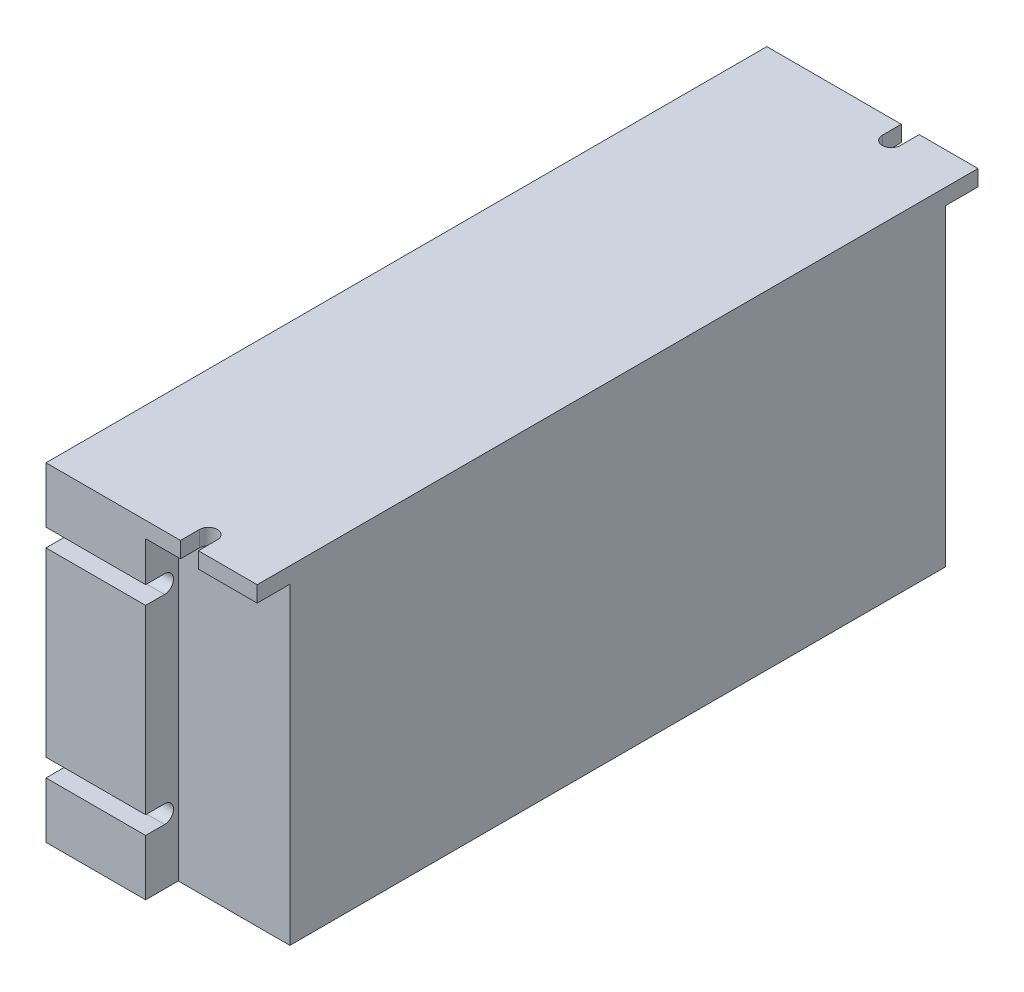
ISO-10303-21;
HEADER;
FILE_DESCRIPTION(('STEP AP214'),'2;1');
FILE_NAME('part.step','',(''),(''),'','','');
FILE_SCHEMA(('AUTOMOTIVE_DESIGN { 1 0 10303 214 1 1 1 1 }'));
ENDSEC;
DATA;
#1=APPLICATION_CONTEXT('core data for automotive mechanical design processes');
#2=APPLICATION_PROTOCOL_DEFINITION('international standard','automotive_design',2000,#1);
#3=PRODUCT_CONTEXT('',#1,'mechanical');
#4=PRODUCT('Part','Part','',(#3));
#5=PRODUCT_RELATED_PRODUCT_CATEGORY('part','',(#4));
#6=PRODUCT_DEFINITION_FORMATION('','',#4);
#7=PRODUCT_DEFINITION_CONTEXT('part definition',#1,'design');
#8=PRODUCT_DEFINITION('design','',#6,#7);
#9=PRODUCT_DEFINITION_SHAPE('','',#8);
#10=(LENGTH_UNIT() NAMED_UNIT(*) SI_UNIT(.MILLI.,.METRE.));
#11=(NAMED_UNIT(*) PLANE_ANGLE_UNIT() SI_UNIT($,.RADIAN.));
#12=(NAMED_UNIT(*) SI_UNIT($,.STERADIAN.) SOLID_ANGLE_UNIT());
#13=UNCERTAINTY_MEASURE_WITH_UNIT(LENGTH_MEASURE(1.E-05),#10,'distance_accuracy_value','');
#14=(GEOMETRIC_REPRESENTATION_CONTEXT(3) GLOBAL_UNCERTAINTY_ASSIGNED_CONTEXT((#13)) GLOBAL_UNIT_ASSIGNED_CONTEXT((#10,
#11,#12)) REPRESENTATION_CONTEXT('',''));
#15=CARTESIAN_POINT('',(0.,0.,0.));
#16=DIRECTION('',(0.,0.,1.));
#17=DIRECTION('',(1.,0.,0.));
#18=AXIS2_PLACEMENT_3D('',#15,#16,#17);
#19=CARTESIAN_POINT('',(53.,-41.25,90.45));
#20=DIRECTION('',(0.,0.,-1.));
#21=DIRECTION('',(-1.,0.,0.));
#22=AXIS2_PLACEMENT_3D('',#19,#20,#21);
#23=PLANE('',#22);
#24=DIRECTION('',(1.,0.,0.));
#25=VECTOR('',#24,1.);
#26=CARTESIAN_POINT('',(25.,37.25,90.45));
#27=LINE('',#26,#25);
#28=CARTESIAN_POINT('',(25.,37.25,90.45));
#29=VERTEX_POINT('',#28);
#30=CARTESIAN_POINT('',(33.75,37.25,90.45));
#31=VERTEX_POINT('',#30);
#32=EDGE_CURVE('E279',#29,#31,#27,.T.);
#33=ORIENTED_EDGE('',*,*,#32,.T.);
#34=DIRECTION('',(0.,1.,0.));
#35=VECTOR('',#34,1.);
#36=CARTESIAN_POINT('',(33.75,37.25,90.45));
#37=LINE('',#36,#35);
#38=CARTESIAN_POINT('',(33.75,41.25,90.45));
#39=VERTEX_POINT('',#38);
#40=EDGE_CURVE('E325',#31,#39,#37,.T.);
#41=ORIENTED_EDGE('',*,*,#40,.T.);
#42=DIRECTION('',(-1.,0.,0.));
#43=VECTOR('',#42,1.);
#44=CARTESIAN_POINT('',(53.,41.25,90.45));
#45=LINE('',#44,#43);
#46=CARTESIAN_POINT('',(0.,41.25,90.45));
#47=VERTEX_POINT('',#46);
#48=EDGE_CURVE('E319',#39,#47,#45,.T.);
#49=ORIENTED_EDGE('',*,*,#48,.T.);
#50=DIRECTION('',(0.,-1.,0.));
#51=VECTOR('',#50,1.);
#52=CARTESIAN_POINT('',(0.,-41.25,90.45));
#53=LINE('',#52,#51);
#54=CARTESIAN_POINT('',(0.,27.25,90.45));
#55=VERTEX_POINT('',#54);
#56=EDGE_CURVE('E310',#47,#55,#53,.T.);
#57=ORIENTED_EDGE('',*,*,#56,.T.);
#58=DIRECTION('',(1.,0.,0.));
#59=VECTOR('',#58,1.);
#60=CARTESIAN_POINT('',(0.,27.25,90.45));
#61=LINE('',#60,#59);
#62=CARTESIAN_POINT('',(25.,27.25,90.45));
#63=VERTEX_POINT('',#62);
#64=EDGE_CURVE('E366',#55,#63,#61,.T.);
#65=ORIENTED_EDGE('',*,*,#64,.T.);
#66=DIRECTION('',(0.,-1.,0.));
#67=VECTOR('',#66,1.);
#68=CARTESIAN_POINT('',(25.,-41.25,90.45));
#69=LINE('',#68,#67);
#70=EDGE_CURVE('E423',#29,#63,#69,.T.);
#71=ORIENTED_EDGE('',*,*,#70,.F.);
#72=EDGE_LOOP('',(#33,#41,#49,#57,#65,#71));
#73=FACE_BOUND('',#72,.T.);
#74=ADVANCED_FACE('F33',(#73),#23,.F.);
#75=CARTESIAN_POINT('',(53.,-41.25,-90.45));
#76=DIRECTION('',(0.,0.,1.));
#77=DIRECTION('',(1.,0.,0.));
#78=AXIS2_PLACEMENT_3D('',#75,#76,#77);
#79=PLANE('',#78);
#80=DIRECTION('',(-1.,0.,0.));
#81=VECTOR('',#80,1.);
#82=CARTESIAN_POINT('',(53.,41.25,-90.45));
#83=LINE('',#82,#81);
#84=CARTESIAN_POINT('',(33.75,41.25,-90.45));
#85=VERTEX_POINT('',#84);
#86=CARTESIAN_POINT('',(0.,41.25,-90.45));
#87=VERTEX_POINT('',#86);
#88=EDGE_CURVE('E41',#85,#87,#83,.T.);
#89=ORIENTED_EDGE('',*,*,#88,.F.);
#90=DIRECTION('',(0.,1.,0.));
#91=VECTOR('',#90,1.);
#92=CARTESIAN_POINT('',(33.75,37.25,-90.45));
#93=LINE('',#92,#91);
#94=CARTESIAN_POINT('',(33.75,37.25,-90.45));
#95=VERTEX_POINT('',#94);
#96=EDGE_CURVE('E565',#95,#85,#93,.T.);
#97=ORIENTED_EDGE('',*,*,#96,.F.);
#98=DIRECTION('',(1.,0.,0.));
#99=VECTOR('',#98,1.);
#100=CARTESIAN_POINT('',(25.,37.25,-90.45));
#101=LINE('',#100,#99);
#102=CARTESIAN_POINT('',(25.,37.25,-90.45));
#103=VERTEX_POINT('',#102);
#104=EDGE_CURVE('E420',#103,#95,#101,.T.);
#105=ORIENTED_EDGE('',*,*,#104,.F.);
#106=DIRECTION('',(0.,1.,0.));
#107=VECTOR('',#106,1.);
#108=CARTESIAN_POINT('',(25.,-41.25,-90.45));
#109=LINE('',#108,#107);
#110=CARTESIAN_POINT('',(25.,27.25,-90.45));
#111=VERTEX_POINT('',#110);
#112=EDGE_CURVE('E401',#111,#103,#109,.T.);
#113=ORIENTED_EDGE('',*,*,#112,.F.);
#114=DIRECTION('',(1.,0.,0.));
#115=VECTOR('',#114,1.);
#116=CARTESIAN_POINT('',(0.,27.25,-90.45));
#117=LINE('',#116,#115);
#118=CARTESIAN_POINT('',(0.,27.25,-90.45));
#119=VERTEX_POINT('',#118);
#120=EDGE_CURVE('E607',#119,#111,#117,.T.);
#121=ORIENTED_EDGE('',*,*,#120,.F.);
#122=DIRECTION('',(0.,1.,0.));
#123=VECTOR('',#122,1.);
#124=CARTESIAN_POINT('',(0.,-41.25,-90.45));
#125=LINE('',#124,#123);
#126=EDGE_CURVE('E283',#119,#87,#125,.T.);
#127=ORIENTED_EDGE('',*,*,#126,.T.);
#128=EDGE_LOOP('',(#89,#97,#105,#113,#121,#127));
#129=FACE_BOUND('',#128,.T.);
#130=ADVANCED_FACE('F512',(#129),#79,.F.);
#131=CARTESIAN_POINT('',(25.,-22.75,-90.45));
#132=VERTEX_POINT('',#131);
#133=CARTESIAN_POINT('',(25.,22.75,-90.45));
#134=VERTEX_POINT('',#133);
#135=EDGE_CURVE('E400',#132,#134,#109,.T.);
#136=ORIENTED_EDGE('',*,*,#135,.F.);
#137=DIRECTION('',(1.,0.,0.));
#138=VECTOR('',#137,1.);
#139=CARTESIAN_POINT('',(0.,-22.75,-90.45));
#140=LINE('',#139,#138);
#141=CARTESIAN_POINT('',(0.,-22.75,-90.45));
#142=VERTEX_POINT('',#141);
#143=EDGE_CURVE('E584',#142,#132,#140,.T.);
#144=ORIENTED_EDGE('',*,*,#143,.F.);
#145=CARTESIAN_POINT('',(0.,22.75,-90.45));
#146=VERTEX_POINT('',#145);
#147=EDGE_CURVE('E306',#142,#146,#125,.T.);
#148=ORIENTED_EDGE('',*,*,#147,.T.);
#149=DIRECTION('',(1.,0.,0.));
#150=VECTOR('',#149,1.);
#151=CARTESIAN_POINT('',(0.,22.75,-90.45));
#152=LINE('',#151,#150);
#153=EDGE_CURVE('E609',#146,#134,#152,.T.);
#154=ORIENTED_EDGE('',*,*,#153,.T.);
#155=EDGE_LOOP('',(#136,#144,#148,#154));
#156=FACE_BOUND('',#155,.T.);
#157=ADVANCED_FACE('F517',(#156),#79,.F.);
#158=CARTESIAN_POINT('',(38.25,37.25,-90.45));
#159=VERTEX_POINT('',#158);
#160=CARTESIAN_POINT('',(53.,37.25,-90.45));
#161=VERTEX_POINT('',#160);
#162=EDGE_CURVE('E409',#159,#161,#101,.T.);
#163=ORIENTED_EDGE('',*,*,#162,.F.);
#164=DIRECTION('',(0.,1.,0.));
#165=VECTOR('',#164,1.);
#166=CARTESIAN_POINT('',(38.25,37.25,-90.45));
#167=LINE('',#166,#165);
#168=CARTESIAN_POINT('',(38.25,41.25,-90.45));
#169=VERTEX_POINT('',#168);
#170=EDGE_CURVE('E56',#159,#169,#167,.T.);
#171=ORIENTED_EDGE('',*,*,#170,.T.);
#172=CARTESIAN_POINT('',(53.,41.25,-90.45));
#173=VERTEX_POINT('',#172);
#174=EDGE_CURVE('E11',#173,#169,#83,.T.);
#175=ORIENTED_EDGE('',*,*,#174,.F.);
#176=DIRECTION('',(0.,1.,0.));
#177=VECTOR('',#176,1.);
#178=CARTESIAN_POINT('',(53.,-41.25,-90.45));
#179=LINE('',#178,#177);
#180=EDGE_CURVE('E291',#161,#173,#179,.T.);
#181=ORIENTED_EDGE('',*,*,#180,.F.);
#182=EDGE_LOOP('',(#163,#171,#175,#181));
#183=FACE_BOUND('',#182,.T.);
#184=ADVANCED_FACE('F521',(#183),#79,.F.);
#185=CARTESIAN_POINT('',(25.,22.75,90.45));
#186=VERTEX_POINT('',#185);
#187=CARTESIAN_POINT('',(25.,-22.75,90.45));
#188=VERTEX_POINT('',#187);
#189=EDGE_CURVE('E427',#186,#188,#69,.T.);
#190=ORIENTED_EDGE('',*,*,#189,.F.);
#191=DIRECTION('',(1.,0.,0.));
#192=VECTOR('',#191,1.);
#193=CARTESIAN_POINT('',(0.,22.75,90.45));
#194=LINE('',#193,#192);
#195=CARTESIAN_POINT('',(0.,22.75,90.45));
#196=VERTEX_POINT('',#195);
#197=EDGE_CURVE('E364',#196,#186,#194,.T.);
#198=ORIENTED_EDGE('',*,*,#197,.F.);
#199=CARTESIAN_POINT('',(0.,-22.75,90.45));
#200=VERTEX_POINT('',#199);
#201=EDGE_CURVE('E313',#196,#200,#53,.T.);
#202=ORIENTED_EDGE('',*,*,#201,.T.);
#203=DIRECTION('',(1.,0.,0.));
#204=VECTOR('',#203,1.);
#205=CARTESIAN_POINT('',(0.,-22.75,90.45));
#206=LINE('',#205,#204);
#207=EDGE_CURVE('E391',#200,#188,#206,.T.);
#208=ORIENTED_EDGE('',*,*,#207,.T.);
#209=EDGE_LOOP('',(#190,#198,#202,#208));
#210=FACE_BOUND('',#209,.T.);
#211=ADVANCED_FACE('F454',(#210),#23,.F.);
#212=CARTESIAN_POINT('',(25.,-27.25,90.45));
#213=VERTEX_POINT('',#212);
#214=CARTESIAN_POINT('',(25.,-41.25,90.45));
#215=VERTEX_POINT('',#214);
#216=EDGE_CURVE('E428',#213,#215,#69,.T.);
#217=ORIENTED_EDGE('',*,*,#216,.F.);
#218=DIRECTION('',(1.,0.,0.));
#219=VECTOR('',#218,1.);
#220=CARTESIAN_POINT('',(0.,-27.25,90.45));
#221=LINE('',#220,#219);
#222=CARTESIAN_POINT('',(0.,-27.25,90.45));
#223=VERTEX_POINT('',#222);
#224=EDGE_CURVE('E389',#223,#213,#221,.T.);
#225=ORIENTED_EDGE('',*,*,#224,.F.);
#226=CARTESIAN_POINT('',(0.,-41.25,90.45));
#227=VERTEX_POINT('',#226);
#228=EDGE_CURVE('E309',#223,#227,#53,.T.);
#229=ORIENTED_EDGE('',*,*,#228,.T.);
#230=DIRECTION('',(-1.,0.,0.));
#231=VECTOR('',#230,1.);
#232=CARTESIAN_POINT('',(53.,-41.25,90.45));
#233=LINE('',#232,#231);
#234=EDGE_CURVE('E317',#215,#227,#233,.T.);
#235=ORIENTED_EDGE('',*,*,#234,.F.);
#236=EDGE_LOOP('',(#217,#225,#229,#235));
#237=FACE_BOUND('',#236,.T.);
#238=ADVANCED_FACE('F460',(#237),#23,.F.);
#239=CARTESIAN_POINT('',(0.,-41.25,-90.45));
#240=VERTEX_POINT('',#239);
#241=CARTESIAN_POINT('',(0.,-27.25,-90.45));
#242=VERTEX_POINT('',#241);
#243=EDGE_CURVE('E302',#240,#242,#125,.T.);
#244=ORIENTED_EDGE('',*,*,#243,.T.);
#245=DIRECTION('',(1.,0.,0.));
#246=VECTOR('',#245,1.);
#247=CARTESIAN_POINT('',(0.,-27.25,-90.45));
#248=LINE('',#247,#246);
#249=CARTESIAN_POINT('',(25.,-27.25,-90.45));
#250=VERTEX_POINT('',#249);
#251=EDGE_CURVE('E475',#242,#250,#248,.T.);
#252=ORIENTED_EDGE('',*,*,#251,.T.);
#253=CARTESIAN_POINT('',(25.,-41.25,-90.45));
#254=VERTEX_POINT('',#253);
#255=EDGE_CURVE('E396',#254,#250,#109,.T.);
#256=ORIENTED_EDGE('',*,*,#255,.F.);
#257=DIRECTION('',(-1.,0.,0.));
#258=VECTOR('',#257,1.);
#259=CARTESIAN_POINT('',(53.,-41.25,-90.45));
#260=LINE('',#259,#258);
#261=EDGE_CURVE('E301',#254,#240,#260,.T.);
#262=ORIENTED_EDGE('',*,*,#261,.T.);
#263=EDGE_LOOP('',(#244,#252,#256,#262));
#264=FACE_BOUND('',#263,.T.);
#265=ADVANCED_FACE('F35',(#264),#79,.F.);
#266=CARTESIAN_POINT('',(53.,41.25,90.45));
#267=DIRECTION('',(0.,-1.,0.));
#268=DIRECTION('',(0.,0.,-1.));
#269=AXIS2_PLACEMENT_3D('',#266,#267,#268);
#270=PLANE('',#269);
#271=ORIENTED_EDGE('',*,*,#48,.F.);
#272=DIRECTION('',(0.,0.,1.));
#273=VECTOR('',#272,1.);
#274=CARTESIAN_POINT('',(33.75,41.25,85.7));
#275=LINE('',#274,#273);
#276=CARTESIAN_POINT('',(33.75,41.25,85.7));
#277=VERTEX_POINT('',#276);
#278=EDGE_CURVE('E263',#277,#39,#275,.T.);
#279=ORIENTED_EDGE('',*,*,#278,.F.);
#280=CARTESIAN_POINT('',(36.,41.25,85.7));
#281=DIRECTION('',(0.,1.,0.));
#282=DIRECTION('',(0.,0.,1.));
#283=AXIS2_PLACEMENT_3D('',#280,#281,#282);
#284=CIRCLE('',#283,2.25);
#285=CARTESIAN_POINT('',(38.25,41.25,85.7));
#286=VERTEX_POINT('',#285);
#287=EDGE_CURVE('E734',#286,#277,#284,.T.);
#288=ORIENTED_EDGE('',*,*,#287,.F.);
#289=DIRECTION('',(0.,0.,-1.));
#290=VECTOR('',#289,1.);
#291=CARTESIAN_POINT('',(38.25,41.25,85.7));
#292=LINE('',#291,#290);
#293=CARTESIAN_POINT('',(38.25,41.25,90.45));
#294=VERTEX_POINT('',#293);
#295=EDGE_CURVE('E736',#294,#286,#292,.T.);
#296=ORIENTED_EDGE('',*,*,#295,.F.);
#297=CARTESIAN_POINT('',(53.,41.25,90.45));
#298=VERTEX_POINT('',#297);
#299=EDGE_CURVE('E272',#298,#294,#45,.T.);
#300=ORIENTED_EDGE('',*,*,#299,.F.);
#301=DIRECTION('',(0.,0.,1.));
#302=VECTOR('',#301,1.);
#303=CARTESIAN_POINT('',(53.,41.25,90.45));
#304=LINE('',#303,#302);
#305=EDGE_CURVE('E293',#173,#298,#304,.T.);
#306=ORIENTED_EDGE('',*,*,#305,.F.);
#307=ORIENTED_EDGE('',*,*,#174,.T.);
#308=DIRECTION('',(0.,0.,-1.));
#309=VECTOR('',#308,1.);
#310=CARTESIAN_POINT('',(38.25,41.25,-90.45));
#311=LINE('',#310,#309);
#312=CARTESIAN_POINT('',(38.25,41.25,-85.7));
#313=VERTEX_POINT('',#312);
#314=EDGE_CURVE('E558',#313,#169,#311,.T.);
#315=ORIENTED_EDGE('',*,*,#314,.F.);
#316=CARTESIAN_POINT('',(36.,41.25,-85.7));
#317=DIRECTION('',(0.,1.,0.));
#318=DIRECTION('',(0.,0.,1.));
#319=AXIS2_PLACEMENT_3D('',#316,#317,#318);
#320=CIRCLE('',#319,2.25);
#321=CARTESIAN_POINT('',(33.75,41.25,-85.7));
#322=VERTEX_POINT('',#321);
#323=EDGE_CURVE('E555',#322,#313,#320,.T.);
#324=ORIENTED_EDGE('',*,*,#323,.F.);
#325=DIRECTION('',(0.,0.,1.));
#326=VECTOR('',#325,1.);
#327=CARTESIAN_POINT('',(33.75,41.25,-85.7));
#328=LINE('',#327,#326);
#329=EDGE_CURVE('E552',#85,#322,#328,.T.);
#330=ORIENTED_EDGE('',*,*,#329,.F.);
#331=ORIENTED_EDGE('',*,*,#88,.T.);
#332=DIRECTION('',(0.,0.,1.));
#333=VECTOR('',#332,1.);
#334=CARTESIAN_POINT('',(0.,41.25,90.45));
#335=LINE('',#334,#333);
#336=EDGE_CURVE('E305',#87,#47,#335,.T.);
#337=ORIENTED_EDGE('',*,*,#336,.T.);
#338=EDGE_LOOP('',(#271,#279,#288,#296,#300,#306,#307,#315,#324,#330,#331,#337));
#339=FACE_BOUND('',#338,.T.);
#340=ADVANCED_FACE('F329',(#339),#270,.F.);
#341=ORIENTED_EDGE('',*,*,#299,.T.);
#342=DIRECTION('',(0.,1.,0.));
#343=VECTOR('',#342,1.);
#344=CARTESIAN_POINT('',(38.25,37.25,90.45));
#345=LINE('',#344,#343);
#346=CARTESIAN_POINT('',(38.25,37.25,90.45));
#347=VERTEX_POINT('',#346);
#348=EDGE_CURVE('E258',#347,#294,#345,.T.);
#349=ORIENTED_EDGE('',*,*,#348,.F.);
#350=CARTESIAN_POINT('',(53.,37.25,90.45));
#351=VERTEX_POINT('',#350);
#352=EDGE_CURVE('E269',#347,#351,#27,.T.);
#353=ORIENTED_EDGE('',*,*,#352,.T.);
#354=DIRECTION('',(0.,-1.,0.));
#355=VECTOR('',#354,1.);
#356=CARTESIAN_POINT('',(53.,-41.25,90.45));
#357=LINE('',#356,#355);
#358=EDGE_CURVE('E296',#298,#351,#357,.T.);
#359=ORIENTED_EDGE('',*,*,#358,.F.);
#360=EDGE_LOOP('',(#341,#349,#353,#359));
#361=FACE_BOUND('',#360,.T.);
#362=ADVANCED_FACE('F267',(#361),#23,.F.);
#363=CARTESIAN_POINT('',(53.,-41.25,90.45));
#364=DIRECTION('',(0.,1.,0.));
#365=DIRECTION('',(0.,0.,1.));
#366=AXIS2_PLACEMENT_3D('',#363,#364,#365);
#367=PLANE('',#366);
#368=DIRECTION('',(0.,0.,-1.));
#369=VECTOR('',#368,1.);
#370=CARTESIAN_POINT('',(25.,-41.25,-82.25));
#371=LINE('',#370,#369);
#372=CARTESIAN_POINT('',(25.,-41.25,-82.25));
#373=VERTEX_POINT('',#372);
#374=EDGE_CURVE('E407',#373,#254,#371,.T.);
#375=ORIENTED_EDGE('',*,*,#374,.F.);
#376=DIRECTION('',(1.,0.,0.));
#377=VECTOR('',#376,1.);
#378=CARTESIAN_POINT('',(25.,-41.25,-82.25));
#379=LINE('',#378,#377);
#380=CARTESIAN_POINT('',(53.,-41.25,-82.25));
#381=VERTEX_POINT('',#380);
#382=EDGE_CURVE('E414',#373,#381,#379,.T.);
#383=ORIENTED_EDGE('',*,*,#382,.T.);
#384=DIRECTION('',(0.,0.,-1.));
#385=VECTOR('',#384,1.);
#386=CARTESIAN_POINT('',(53.,-41.25,90.45));
#387=LINE('',#386,#385);
#388=CARTESIAN_POINT('',(53.,-41.25,82.25));
#389=VERTEX_POINT('',#388);
#390=EDGE_CURVE('E298',#389,#381,#387,.T.);
#391=ORIENTED_EDGE('',*,*,#390,.F.);
#392=DIRECTION('',(1.,0.,0.));
#393=VECTOR('',#392,1.);
#394=CARTESIAN_POINT('',(25.,-41.25,82.25));
#395=LINE('',#394,#393);
#396=CARTESIAN_POINT('',(25.,-41.25,82.25));
#397=VERTEX_POINT('',#396);
#398=EDGE_CURVE('E284',#397,#389,#395,.T.);
#399=ORIENTED_EDGE('',*,*,#398,.F.);
#400=DIRECTION('',(0.,0.,-1.));
#401=VECTOR('',#400,1.);
#402=CARTESIAN_POINT('',(25.,-41.25,90.45));
#403=LINE('',#402,#401);
#404=EDGE_CURVE('E426',#215,#397,#403,.T.);
#405=ORIENTED_EDGE('',*,*,#404,.F.);
#406=ORIENTED_EDGE('',*,*,#234,.T.);
#407=DIRECTION('',(0.,0.,-1.));
#408=VECTOR('',#407,1.);
#409=CARTESIAN_POINT('',(0.,-41.25,90.45));
#410=LINE('',#409,#408);
#411=EDGE_CURVE('E294',#227,#240,#410,.T.);
#412=ORIENTED_EDGE('',*,*,#411,.T.);
#413=ORIENTED_EDGE('',*,*,#261,.F.);
#414=EDGE_LOOP('',(#375,#383,#391,#399,#405,#406,#412,#413));
#415=FACE_BOUND('',#414,.T.);
#416=ADVANCED_FACE('F464',(#415),#367,.F.);
#417=CARTESIAN_POINT('',(53.,0.,0.));
#418=DIRECTION('',(-1.,0.,0.));
#419=DIRECTION('',(0.,0.,1.));
#420=AXIS2_PLACEMENT_3D('',#417,#418,#419);
#421=PLANE('',#420);
#422=ORIENTED_EDGE('',*,*,#390,.T.);
#423=DIRECTION('',(0.,-1.,0.));
#424=VECTOR('',#423,1.);
#425=CARTESIAN_POINT('',(53.,37.25,-82.25));
#426=LINE('',#425,#424);
#427=CARTESIAN_POINT('',(53.,37.25,-82.25));
#428=VERTEX_POINT('',#427);
#429=EDGE_CURVE('E412',#428,#381,#426,.T.);
#430=ORIENTED_EDGE('',*,*,#429,.F.);
#431=DIRECTION('',(0.,0.,1.));
#432=VECTOR('',#431,1.);
#433=CARTESIAN_POINT('',(53.,37.25,-90.45));
#434=LINE('',#433,#432);
#435=EDGE_CURVE('E388',#161,#428,#434,.T.);
#436=ORIENTED_EDGE('',*,*,#435,.F.);
#437=ORIENTED_EDGE('',*,*,#180,.T.);
#438=ORIENTED_EDGE('',*,*,#305,.T.);
#439=ORIENTED_EDGE('',*,*,#358,.T.);
#440=DIRECTION('',(0.,0.,1.));
#441=VECTOR('',#440,1.);
#442=CARTESIAN_POINT('',(53.,37.25,90.45));
#443=LINE('',#442,#441);
#444=CARTESIAN_POINT('',(53.,37.25,82.25));
#445=VERTEX_POINT('',#444);
#446=EDGE_CURVE('E277',#445,#351,#443,.T.);
#447=ORIENTED_EDGE('',*,*,#446,.F.);
#448=DIRECTION('',(0.,1.,0.));
#449=VECTOR('',#448,1.);
#450=CARTESIAN_POINT('',(53.,37.25,82.25));
#451=LINE('',#450,#449);
#452=EDGE_CURVE('E417',#389,#445,#451,.T.);
#453=ORIENTED_EDGE('',*,*,#452,.F.);
#454=EDGE_LOOP('',(#422,#430,#436,#437,#438,#439,#447,#453));
#455=FACE_BOUND('',#454,.T.);
#456=ADVANCED_FACE('F488',(#455),#421,.F.);
#457=CARTESIAN_POINT('',(0.,0.,0.));
#458=DIRECTION('',(-1.,0.,0.));
#459=DIRECTION('',(0.,0.,1.));
#460=AXIS2_PLACEMENT_3D('',#457,#458,#459);
#461=PLANE('',#460);
#462=DIRECTION('',(0.,0.,1.));
#463=VECTOR('',#462,1.);
#464=CARTESIAN_POINT('',(0.,-22.75,-85.7));
#465=LINE('',#464,#463);
#466=CARTESIAN_POINT('',(0.,-22.75,-85.7));
#467=VERTEX_POINT('',#466);
#468=EDGE_CURVE('E573',#142,#467,#465,.T.);
#469=ORIENTED_EDGE('',*,*,#468,.T.);
#470=CARTESIAN_POINT('',(0.,-25.,-85.7));
#471=DIRECTION('',(1.,0.,0.));
#472=DIRECTION('',(0.,0.,-1.));
#473=AXIS2_PLACEMENT_3D('',#470,#471,#472);
#474=CIRCLE('',#473,2.25);
#475=CARTESIAN_POINT('',(0.,-27.25,-85.7));
#476=VERTEX_POINT('',#475);
#477=EDGE_CURVE('E569',#467,#476,#474,.T.);
#478=ORIENTED_EDGE('',*,*,#477,.T.);
#479=DIRECTION('',(0.,0.,-1.));
#480=VECTOR('',#479,1.);
#481=CARTESIAN_POINT('',(0.,-27.25,-90.45));
#482=LINE('',#481,#480);
#483=EDGE_CURVE('E471',#476,#242,#482,.T.);
#484=ORIENTED_EDGE('',*,*,#483,.T.);
#485=ORIENTED_EDGE('',*,*,#243,.F.);
#486=ORIENTED_EDGE('',*,*,#411,.F.);
#487=ORIENTED_EDGE('',*,*,#228,.F.);
#488=DIRECTION('',(0.,0.,-1.));
#489=VECTOR('',#488,1.);
#490=CARTESIAN_POINT('',(0.,-27.25,90.45));
#491=LINE('',#490,#489);
#492=CARTESIAN_POINT('',(0.,-27.25,85.7));
#493=VERTEX_POINT('',#492);
#494=EDGE_CURVE('E376',#223,#493,#491,.T.);
#495=ORIENTED_EDGE('',*,*,#494,.T.);
#496=CARTESIAN_POINT('',(0.,-25.,85.7));
#497=DIRECTION('',(1.,0.,0.));
#498=DIRECTION('',(0.,0.,-1.));
#499=AXIS2_PLACEMENT_3D('',#496,#497,#498);
#500=CIRCLE('',#499,2.25);
#501=CARTESIAN_POINT('',(0.,-22.75,85.7));
#502=VERTEX_POINT('',#501);
#503=EDGE_CURVE('E369',#493,#502,#500,.T.);
#504=ORIENTED_EDGE('',*,*,#503,.T.);
#505=DIRECTION('',(0.,0.,1.));
#506=VECTOR('',#505,1.);
#507=CARTESIAN_POINT('',(0.,-22.75,85.7));
#508=LINE('',#507,#506);
#509=EDGE_CURVE('E372',#502,#200,#508,.T.);
#510=ORIENTED_EDGE('',*,*,#509,.T.);
#511=ORIENTED_EDGE('',*,*,#201,.F.);
#512=DIRECTION('',(0.,0.,-1.));
#513=VECTOR('',#512,1.);
#514=CARTESIAN_POINT('',(0.,22.75,90.45));
#515=LINE('',#514,#513);
#516=CARTESIAN_POINT('',(0.,22.75,85.7));
#517=VERTEX_POINT('',#516);
#518=EDGE_CURVE('E346',#196,#517,#515,.T.);
#519=ORIENTED_EDGE('',*,*,#518,.T.);
#520=CARTESIAN_POINT('',(0.,25.,85.7));
#521=DIRECTION('',(1.,0.,0.));
#522=DIRECTION('',(0.,0.,-1.));
#523=AXIS2_PLACEMENT_3D('',#520,#521,#522);
#524=CIRCLE('',#523,2.25);
#525=CARTESIAN_POINT('',(0.,27.25,85.7));
#526=VERTEX_POINT('',#525);
#527=EDGE_CURVE('E343',#517,#526,#524,.T.);
#528=ORIENTED_EDGE('',*,*,#527,.T.);
#529=DIRECTION('',(0.,0.,1.));
#530=VECTOR('',#529,1.);
#531=CARTESIAN_POINT('',(0.,27.25,85.7));
#532=LINE('',#531,#530);
#533=EDGE_CURVE('E340',#526,#55,#532,.T.);
#534=ORIENTED_EDGE('',*,*,#533,.T.);
#535=ORIENTED_EDGE('',*,*,#56,.F.);
#536=ORIENTED_EDGE('',*,*,#336,.F.);
#537=ORIENTED_EDGE('',*,*,#126,.F.);
#538=DIRECTION('',(0.,0.,1.));
#539=VECTOR('',#538,1.);
#540=CARTESIAN_POINT('',(0.,27.25,-90.45));
#541=LINE('',#540,#539);
#542=CARTESIAN_POINT('',(0.,27.25,-85.7));
#543=VERTEX_POINT('',#542);
#544=EDGE_CURVE('E596',#119,#543,#541,.T.);
#545=ORIENTED_EDGE('',*,*,#544,.T.);
#546=CARTESIAN_POINT('',(0.,25.,-85.7));
#547=DIRECTION('',(1.,0.,0.));
#548=DIRECTION('',(0.,0.,-1.));
#549=AXIS2_PLACEMENT_3D('',#546,#547,#548);
#550=CIRCLE('',#549,2.25);
#551=CARTESIAN_POINT('',(0.,22.75,-85.7));
#552=VERTEX_POINT('',#551);
#553=EDGE_CURVE('E589',#543,#552,#550,.T.);
#554=ORIENTED_EDGE('',*,*,#553,.T.);
#555=DIRECTION('',(0.,0.,-1.));
#556=VECTOR('',#555,1.);
#557=CARTESIAN_POINT('',(0.,22.75,-85.7));
#558=LINE('',#557,#556);
#559=EDGE_CURVE('E592',#552,#146,#558,.T.);
#560=ORIENTED_EDGE('',*,*,#559,.T.);
#561=ORIENTED_EDGE('',*,*,#147,.F.);
#562=EDGE_LOOP('',(#469,#478,#484,#485,#486,#487,#495,#504,#510,#511,#519,#528,#534,#535,#536,
#537,#545,#554,#560,#561));
#563=FACE_BOUND('',#562,.T.);
#564=ADVANCED_FACE('F337',(#563),#461,.T.);
#565=CARTESIAN_POINT('',(25.,37.25,90.45));
#566=DIRECTION('',(0.,1.,0.));
#567=DIRECTION('',(0.,0.,1.));
#568=AXIS2_PLACEMENT_3D('',#565,#566,#567);
#569=PLANE('',#568);
#570=CARTESIAN_POINT('',(36.,37.25,85.7));
#571=DIRECTION('',(0.,1.,0.));
#572=DIRECTION('',(0.,0.,1.));
#573=AXIS2_PLACEMENT_3D('',#570,#571,#572);
#574=CIRCLE('',#573,2.25);
#575=CARTESIAN_POINT('',(38.25,37.25,85.7));
#576=VERTEX_POINT('',#575);
#577=CARTESIAN_POINT('',(33.75,37.25,85.7));
#578=VERTEX_POINT('',#577);
#579=EDGE_CURVE('E48',#576,#578,#574,.T.);
#580=ORIENTED_EDGE('',*,*,#579,.T.);
#581=DIRECTION('',(0.,0.,1.));
#582=VECTOR('',#581,1.);
#583=CARTESIAN_POINT('',(33.75,37.25,85.7));
#584=LINE('',#583,#582);
#585=EDGE_CURVE('E273',#578,#31,#584,.T.);
#586=ORIENTED_EDGE('',*,*,#585,.T.);
#587=ORIENTED_EDGE('',*,*,#32,.F.);
#588=DIRECTION('',(0.,0.,1.));
#589=VECTOR('',#588,1.);
#590=CARTESIAN_POINT('',(25.,37.25,90.45));
#591=LINE('',#590,#589);
#592=CARTESIAN_POINT('',(25.,37.25,82.25));
#593=VERTEX_POINT('',#592);
#594=EDGE_CURVE('E290',#593,#29,#591,.T.);
#595=ORIENTED_EDGE('',*,*,#594,.F.);
#596=DIRECTION('',(1.,0.,0.));
#597=VECTOR('',#596,1.);
#598=CARTESIAN_POINT('',(25.,37.25,82.25));
#599=LINE('',#598,#597);
#600=EDGE_CURVE('E280',#593,#445,#599,.T.);
#601=ORIENTED_EDGE('',*,*,#600,.T.);
#602=ORIENTED_EDGE('',*,*,#446,.T.);
#603=ORIENTED_EDGE('',*,*,#352,.F.);
#604=DIRECTION('',(0.,0.,-1.));
#605=VECTOR('',#604,1.);
#606=CARTESIAN_POINT('',(38.25,37.25,85.7));
#607=LINE('',#606,#605);
#608=EDGE_CURVE('E254',#347,#576,#607,.T.);
#609=ORIENTED_EDGE('',*,*,#608,.T.);
#610=EDGE_LOOP('',(#580,#586,#587,#595,#601,#602,#603,#609));
#611=FACE_BOUND('',#610,.T.);
#612=ADVANCED_FACE('F275',(#611),#569,.F.);
#613=CARTESIAN_POINT('',(25.,37.25,82.25));
#614=DIRECTION('',(0.,0.,-1.));
#615=DIRECTION('',(-1.,0.,0.));
#616=AXIS2_PLACEMENT_3D('',#613,#614,#615);
#617=PLANE('',#616);
#618=ORIENTED_EDGE('',*,*,#452,.T.);
#619=ORIENTED_EDGE('',*,*,#600,.F.);
#620=DIRECTION('',(0.,1.,0.));
#621=VECTOR('',#620,1.);
#622=CARTESIAN_POINT('',(25.,37.25,82.25));
#623=LINE('',#622,#621);
#624=EDGE_CURVE('E431',#397,#593,#623,.T.);
#625=ORIENTED_EDGE('',*,*,#624,.F.);
#626=ORIENTED_EDGE('',*,*,#398,.T.);
#627=EDGE_LOOP('',(#618,#619,#625,#626));
#628=FACE_BOUND('',#627,.T.);
#629=ADVANCED_FACE('F490',(#628),#617,.F.);
#630=CARTESIAN_POINT('',(25.,0.,0.));
#631=DIRECTION('',(-1.,0.,0.));
#632=DIRECTION('',(0.,0.,1.));
#633=AXIS2_PLACEMENT_3D('',#630,#631,#632);
#634=PLANE('',#633);
#635=CARTESIAN_POINT('',(25.,25.,85.7));
#636=DIRECTION('',(1.,0.,0.));
#637=DIRECTION('',(0.,0.,-1.));
#638=AXIS2_PLACEMENT_3D('',#635,#636,#637);
#639=CIRCLE('',#638,2.25);
#640=CARTESIAN_POINT('',(25.,22.75,85.7));
#641=VERTEX_POINT('',#640);
#642=CARTESIAN_POINT('',(25.,27.25,85.7));
#643=VERTEX_POINT('',#642);
#644=EDGE_CURVE('E354',#641,#643,#639,.T.);
#645=ORIENTED_EDGE('',*,*,#644,.F.);
#646=DIRECTION('',(0.,0.,-1.));
#647=VECTOR('',#646,1.);
#648=CARTESIAN_POINT('',(25.,22.75,90.45));
#649=LINE('',#648,#647);
#650=EDGE_CURVE('E350',#186,#641,#649,.T.);
#651=ORIENTED_EDGE('',*,*,#650,.F.);
#652=ORIENTED_EDGE('',*,*,#189,.T.);
#653=DIRECTION('',(0.,0.,1.));
#654=VECTOR('',#653,1.);
#655=CARTESIAN_POINT('',(25.,-22.75,85.7));
#656=LINE('',#655,#654);
#657=CARTESIAN_POINT('',(25.,-22.75,85.7));
#658=VERTEX_POINT('',#657);
#659=EDGE_CURVE('E381',#658,#188,#656,.T.);
#660=ORIENTED_EDGE('',*,*,#659,.F.);
#661=CARTESIAN_POINT('',(25.,-25.,85.7));
#662=DIRECTION('',(1.,0.,0.));
#663=DIRECTION('',(0.,0.,-1.));
#664=AXIS2_PLACEMENT_3D('',#661,#662,#663);
#665=CIRCLE('',#664,2.25);
#666=CARTESIAN_POINT('',(25.,-27.25,85.7));
#667=VERTEX_POINT('',#666);
#668=EDGE_CURVE('E363',#667,#658,#665,.T.);
#669=ORIENTED_EDGE('',*,*,#668,.F.);
#670=DIRECTION('',(0.,0.,-1.));
#671=VECTOR('',#670,1.);
#672=CARTESIAN_POINT('',(25.,-27.25,90.45));
#673=LINE('',#672,#671);
#674=EDGE_CURVE('E373',#213,#667,#673,.T.);
#675=ORIENTED_EDGE('',*,*,#674,.F.);
#676=ORIENTED_EDGE('',*,*,#216,.T.);
#677=ORIENTED_EDGE('',*,*,#404,.T.);
#678=ORIENTED_EDGE('',*,*,#624,.T.);
#679=ORIENTED_EDGE('',*,*,#594,.T.);
#680=ORIENTED_EDGE('',*,*,#70,.T.);
#681=DIRECTION('',(0.,0.,1.));
#682=VECTOR('',#681,1.);
#683=CARTESIAN_POINT('',(25.,27.25,85.7));
#684=LINE('',#683,#682);
#685=EDGE_CURVE('E356',#643,#63,#684,.T.);
#686=ORIENTED_EDGE('',*,*,#685,.F.);
#687=EDGE_LOOP('',(#645,#651,#652,#660,#669,#675,#676,#677,#678,#679,#680,#686));
#688=FACE_BOUND('',#687,.T.);
#689=ADVANCED_FACE('F446',(#688),#634,.F.);
#690=CARTESIAN_POINT('',(25.,37.25,-82.25));
#691=DIRECTION('',(0.,0.,1.));
#692=DIRECTION('',(1.,0.,0.));
#693=AXIS2_PLACEMENT_3D('',#690,#691,#692);
#694=PLANE('',#693);
#695=ORIENTED_EDGE('',*,*,#429,.T.);
#696=ORIENTED_EDGE('',*,*,#382,.F.);
#697=DIRECTION('',(0.,-1.,0.));
#698=VECTOR('',#697,1.);
#699=CARTESIAN_POINT('',(25.,37.25,-82.25));
#700=LINE('',#699,#698);
#701=CARTESIAN_POINT('',(25.,37.25,-82.25));
#702=VERTEX_POINT('',#701);
#703=EDGE_CURVE('E404',#702,#373,#700,.T.);
#704=ORIENTED_EDGE('',*,*,#703,.F.);
#705=DIRECTION('',(1.,0.,0.));
#706=VECTOR('',#705,1.);
#707=CARTESIAN_POINT('',(25.,37.25,-82.25));
#708=LINE('',#707,#706);
#709=EDGE_CURVE('E418',#702,#428,#708,.T.);
#710=ORIENTED_EDGE('',*,*,#709,.T.);
#711=EDGE_LOOP('',(#695,#696,#704,#710));
#712=FACE_BOUND('',#711,.T.);
#713=ADVANCED_FACE('F484',(#712),#694,.F.);
#714=CARTESIAN_POINT('',(25.,37.25,-90.45));
#715=DIRECTION('',(0.,1.,0.));
#716=DIRECTION('',(0.,0.,1.));
#717=AXIS2_PLACEMENT_3D('',#714,#715,#716);
#718=PLANE('',#717);
#719=ORIENTED_EDGE('',*,*,#104,.T.);
#720=DIRECTION('',(0.,0.,1.));
#721=VECTOR('',#720,1.);
#722=CARTESIAN_POINT('',(33.75,37.25,-85.7));
#723=LINE('',#722,#721);
#724=CARTESIAN_POINT('',(33.75,37.25,-85.7));
#725=VERTEX_POINT('',#724);
#726=EDGE_CURVE('E548',#95,#725,#723,.T.);
#727=ORIENTED_EDGE('',*,*,#726,.T.);
#728=CARTESIAN_POINT('',(36.,37.25,-85.7));
#729=DIRECTION('',(0.,1.,0.));
#730=DIRECTION('',(0.,0.,1.));
#731=AXIS2_PLACEMENT_3D('',#728,#729,#730);
#732=CIRCLE('',#731,2.25);
#733=CARTESIAN_POINT('',(38.25,37.25,-85.7));
#734=VERTEX_POINT('',#733);
#735=EDGE_CURVE('E547',#725,#734,#732,.T.);
#736=ORIENTED_EDGE('',*,*,#735,.T.);
#737=DIRECTION('',(0.,0.,-1.));
#738=VECTOR('',#737,1.);
#739=CARTESIAN_POINT('',(38.25,37.25,-90.45));
#740=LINE('',#739,#738);
#741=EDGE_CURVE('E544',#734,#159,#740,.T.);
#742=ORIENTED_EDGE('',*,*,#741,.T.);
#743=ORIENTED_EDGE('',*,*,#162,.T.);
#744=ORIENTED_EDGE('',*,*,#435,.T.);
#745=ORIENTED_EDGE('',*,*,#709,.F.);
#746=DIRECTION('',(0.,0.,1.));
#747=VECTOR('',#746,1.);
#748=CARTESIAN_POINT('',(25.,37.25,-90.45));
#749=LINE('',#748,#747);
#750=EDGE_CURVE('E399',#103,#702,#749,.T.);
#751=ORIENTED_EDGE('',*,*,#750,.F.);
#752=EDGE_LOOP('',(#719,#727,#736,#742,#743,#744,#745,#751));
#753=FACE_BOUND('',#752,.T.);
#754=ADVANCED_FACE('F542',(#753),#718,.F.);
#755=CARTESIAN_POINT('',(25.,0.,0.));
#756=DIRECTION('',(1.,0.,0.));
#757=DIRECTION('',(0.,0.,-1.));
#758=AXIS2_PLACEMENT_3D('',#755,#756,#757);
#759=PLANE('',#758);
#760=DIRECTION('',(0.,0.,1.));
#761=VECTOR('',#760,1.);
#762=CARTESIAN_POINT('',(25.,-22.75,-85.7));
#763=LINE('',#762,#761);
#764=CARTESIAN_POINT('',(25.,-22.75,-85.7));
#765=VERTEX_POINT('',#764);
#766=EDGE_CURVE('E571',#132,#765,#763,.T.);
#767=ORIENTED_EDGE('',*,*,#766,.F.);
#768=ORIENTED_EDGE('',*,*,#135,.T.);
#769=DIRECTION('',(0.,0.,-1.));
#770=VECTOR('',#769,1.);
#771=CARTESIAN_POINT('',(25.,22.75,-85.7));
#772=LINE('',#771,#770);
#773=CARTESIAN_POINT('',(25.,22.75,-85.7));
#774=VERTEX_POINT('',#773);
#775=EDGE_CURVE('E601',#774,#134,#772,.T.);
#776=ORIENTED_EDGE('',*,*,#775,.F.);
#777=CARTESIAN_POINT('',(25.,25.,-85.7));
#778=DIRECTION('',(1.,0.,0.));
#779=DIRECTION('',(0.,0.,-1.));
#780=AXIS2_PLACEMENT_3D('',#777,#778,#779);
#781=CIRCLE('',#780,2.25);
#782=CARTESIAN_POINT('',(25.,27.25,-85.7));
#783=VERTEX_POINT('',#782);
#784=EDGE_CURVE('E583',#783,#774,#781,.T.);
#785=ORIENTED_EDGE('',*,*,#784,.F.);
#786=DIRECTION('',(0.,0.,1.));
#787=VECTOR('',#786,1.);
#788=CARTESIAN_POINT('',(25.,27.25,-90.45));
#789=LINE('',#788,#787);
#790=EDGE_CURVE('E593',#111,#783,#789,.T.);
#791=ORIENTED_EDGE('',*,*,#790,.F.);
#792=ORIENTED_EDGE('',*,*,#112,.T.);
#793=ORIENTED_EDGE('',*,*,#750,.T.);
#794=ORIENTED_EDGE('',*,*,#703,.T.);
#795=ORIENTED_EDGE('',*,*,#374,.T.);
#796=ORIENTED_EDGE('',*,*,#255,.T.);
#797=DIRECTION('',(0.,0.,-1.));
#798=VECTOR('',#797,1.);
#799=CARTESIAN_POINT('',(25.,-27.25,-90.45));
#800=LINE('',#799,#798);
#801=CARTESIAN_POINT('',(25.,-27.25,-85.7));
#802=VERTEX_POINT('',#801);
#803=EDGE_CURVE('E577',#802,#250,#800,.T.);
#804=ORIENTED_EDGE('',*,*,#803,.F.);
#805=CARTESIAN_POINT('',(25.,-25.,-85.7));
#806=DIRECTION('',(1.,0.,0.));
#807=DIRECTION('',(0.,0.,-1.));
#808=AXIS2_PLACEMENT_3D('',#805,#806,#807);
#809=CIRCLE('',#808,2.25);
#810=EDGE_CURVE('E564',#765,#802,#809,.T.);
#811=ORIENTED_EDGE('',*,*,#810,.F.);
#812=EDGE_LOOP('',(#767,#768,#776,#785,#791,#792,#793,#794,#795,#796,#804,#811));
#813=FACE_BOUND('',#812,.T.);
#814=ADVANCED_FACE('F479',(#813),#759,.T.);
#815=CARTESIAN_POINT('',(0.,-25.,85.7));
#816=DIRECTION('',(1.,0.,0.));
#817=DIRECTION('',(0.,0.,-1.));
#818=AXIS2_PLACEMENT_3D('',#815,#816,#817);
#819=CYLINDRICAL_SURFACE('',#818,2.25);
#820=ORIENTED_EDGE('',*,*,#668,.T.);
#821=DIRECTION('',(1.,0.,0.));
#822=VECTOR('',#821,1.);
#823=CARTESIAN_POINT('',(0.,-22.75,85.7));
#824=LINE('',#823,#822);
#825=EDGE_CURVE('E379',#502,#658,#824,.T.);
#826=ORIENTED_EDGE('',*,*,#825,.F.);
#827=ORIENTED_EDGE('',*,*,#503,.F.);
#828=DIRECTION('',(1.,0.,0.));
#829=VECTOR('',#828,1.);
#830=CARTESIAN_POINT('',(0.,-27.25,85.7));
#831=LINE('',#830,#829);
#832=EDGE_CURVE('E386',#493,#667,#831,.T.);
#833=ORIENTED_EDGE('',*,*,#832,.T.);
#834=EDGE_LOOP('',(#820,#826,#827,#833));
#835=FACE_BOUND('',#834,.T.);
#836=ADVANCED_FACE('F796',(#835),#819,.F.);
#837=CARTESIAN_POINT('',(0.,-27.25,90.45));
#838=DIRECTION('',(0.,-1.,0.));
#839=DIRECTION('',(0.,0.,-1.));
#840=AXIS2_PLACEMENT_3D('',#837,#838,#839);
#841=PLANE('',#840);
#842=ORIENTED_EDGE('',*,*,#674,.T.);
#843=ORIENTED_EDGE('',*,*,#832,.F.);
#844=ORIENTED_EDGE('',*,*,#494,.F.);
#845=ORIENTED_EDGE('',*,*,#224,.T.);
#846=EDGE_LOOP('',(#842,#843,#844,#845));
#847=FACE_BOUND('',#846,.T.);
#848=ADVANCED_FACE('F788',(#847),#841,.F.);
#849=CARTESIAN_POINT('',(0.,-22.75,85.7));
#850=DIRECTION('',(0.,1.,0.));
#851=DIRECTION('',(0.,0.,1.));
#852=AXIS2_PLACEMENT_3D('',#849,#850,#851);
#853=PLANE('',#852);
#854=ORIENTED_EDGE('',*,*,#659,.T.);
#855=ORIENTED_EDGE('',*,*,#207,.F.);
#856=ORIENTED_EDGE('',*,*,#509,.F.);
#857=ORIENTED_EDGE('',*,*,#825,.T.);
#858=EDGE_LOOP('',(#854,#855,#856,#857));
#859=FACE_BOUND('',#858,.T.);
#860=ADVANCED_FACE('F452',(#859),#853,.F.);
#861=CARTESIAN_POINT('',(0.,25.,85.7));
#862=DIRECTION('',(1.,0.,0.));
#863=DIRECTION('',(0.,0.,-1.));
#864=AXIS2_PLACEMENT_3D('',#861,#862,#863);
#865=CYLINDRICAL_SURFACE('',#864,2.25);
#866=ORIENTED_EDGE('',*,*,#644,.T.);
#867=DIRECTION('',(1.,0.,0.));
#868=VECTOR('',#867,1.);
#869=CARTESIAN_POINT('',(0.,27.25,85.7));
#870=LINE('',#869,#868);
#871=EDGE_CURVE('E348',#526,#643,#870,.T.);
#872=ORIENTED_EDGE('',*,*,#871,.F.);
#873=ORIENTED_EDGE('',*,*,#527,.F.);
#874=DIRECTION('',(1.,0.,0.));
#875=VECTOR('',#874,1.);
#876=CARTESIAN_POINT('',(0.,22.75,85.7));
#877=LINE('',#876,#875);
#878=EDGE_CURVE('E361',#517,#641,#877,.T.);
#879=ORIENTED_EDGE('',*,*,#878,.T.);
#880=EDGE_LOOP('',(#866,#872,#873,#879));
#881=FACE_BOUND('',#880,.T.);
#882=ADVANCED_FACE('F498',(#881),#865,.F.);
#883=CARTESIAN_POINT('',(0.,22.75,90.45));
#884=DIRECTION('',(0.,-1.,0.));
#885=DIRECTION('',(0.,0.,-1.));
#886=AXIS2_PLACEMENT_3D('',#883,#884,#885);
#887=PLANE('',#886);
#888=ORIENTED_EDGE('',*,*,#650,.T.);
#889=ORIENTED_EDGE('',*,*,#878,.F.);
#890=ORIENTED_EDGE('',*,*,#518,.F.);
#891=ORIENTED_EDGE('',*,*,#197,.T.);
#892=EDGE_LOOP('',(#888,#889,#890,#891));
#893=FACE_BOUND('',#892,.T.);
#894=ADVANCED_FACE('F500',(#893),#887,.F.);
#895=CARTESIAN_POINT('',(0.,27.25,85.7));
#896=DIRECTION('',(0.,1.,0.));
#897=DIRECTION('',(0.,0.,1.));
#898=AXIS2_PLACEMENT_3D('',#895,#896,#897);
#899=PLANE('',#898);
#900=ORIENTED_EDGE('',*,*,#685,.T.);
#901=ORIENTED_EDGE('',*,*,#64,.F.);
#902=ORIENTED_EDGE('',*,*,#533,.F.);
#903=ORIENTED_EDGE('',*,*,#871,.T.);
#904=EDGE_LOOP('',(#900,#901,#902,#903));
#905=FACE_BOUND('',#904,.T.);
#906=ADVANCED_FACE('F496',(#905),#899,.F.);
#907=CARTESIAN_POINT('',(0.,25.,-85.7));
#908=DIRECTION('',(1.,0.,0.));
#909=DIRECTION('',(0.,0.,-1.));
#910=AXIS2_PLACEMENT_3D('',#907,#908,#909);
#911=CYLINDRICAL_SURFACE('',#910,2.25);
#912=ORIENTED_EDGE('',*,*,#784,.T.);
#913=DIRECTION('',(1.,0.,0.));
#914=VECTOR('',#913,1.);
#915=CARTESIAN_POINT('',(0.,22.75,-85.7));
#916=LINE('',#915,#914);
#917=EDGE_CURVE('E599',#552,#774,#916,.T.);
#918=ORIENTED_EDGE('',*,*,#917,.F.);
#919=ORIENTED_EDGE('',*,*,#553,.F.);
#920=DIRECTION('',(1.,0.,0.));
#921=VECTOR('',#920,1.);
#922=CARTESIAN_POINT('',(0.,27.25,-85.7));
#923=LINE('',#922,#921);
#924=EDGE_CURVE('E357',#543,#783,#923,.T.);
#925=ORIENTED_EDGE('',*,*,#924,.T.);
#926=EDGE_LOOP('',(#912,#918,#919,#925));
#927=FACE_BOUND('',#926,.T.);
#928=ADVANCED_FACE('F507',(#927),#911,.F.);
#929=CARTESIAN_POINT('',(0.,27.25,-90.45));
#930=DIRECTION('',(0.,1.,0.));
#931=DIRECTION('',(0.,0.,1.));
#932=AXIS2_PLACEMENT_3D('',#929,#930,#931);
#933=PLANE('',#932);
#934=ORIENTED_EDGE('',*,*,#790,.T.);
#935=ORIENTED_EDGE('',*,*,#924,.F.);
#936=ORIENTED_EDGE('',*,*,#544,.F.);
#937=ORIENTED_EDGE('',*,*,#120,.T.);
#938=EDGE_LOOP('',(#934,#935,#936,#937));
#939=FACE_BOUND('',#938,.T.);
#940=ADVANCED_FACE('F662',(#939),#933,.F.);
#941=CARTESIAN_POINT('',(0.,22.75,-85.7));
#942=DIRECTION('',(0.,-1.,0.));
#943=DIRECTION('',(0.,0.,-1.));
#944=AXIS2_PLACEMENT_3D('',#941,#942,#943);
#945=PLANE('',#944);
#946=ORIENTED_EDGE('',*,*,#775,.T.);
#947=ORIENTED_EDGE('',*,*,#153,.F.);
#948=ORIENTED_EDGE('',*,*,#559,.F.);
#949=ORIENTED_EDGE('',*,*,#917,.T.);
#950=EDGE_LOOP('',(#946,#947,#948,#949));
#951=FACE_BOUND('',#950,.T.);
#952=ADVANCED_FACE('F615',(#951),#945,.F.);
#953=CARTESIAN_POINT('',(0.,-25.,-85.7));
#954=DIRECTION('',(1.,0.,0.));
#955=DIRECTION('',(0.,0.,-1.));
#956=AXIS2_PLACEMENT_3D('',#953,#954,#955);
#957=CYLINDRICAL_SURFACE('',#956,2.25);
#958=ORIENTED_EDGE('',*,*,#810,.T.);
#959=DIRECTION('',(1.,0.,0.));
#960=VECTOR('',#959,1.);
#961=CARTESIAN_POINT('',(0.,-27.25,-85.7));
#962=LINE('',#961,#960);
#963=EDGE_CURVE('E575',#476,#802,#962,.T.);
#964=ORIENTED_EDGE('',*,*,#963,.F.);
#965=ORIENTED_EDGE('',*,*,#477,.F.);
#966=DIRECTION('',(1.,0.,0.));
#967=VECTOR('',#966,1.);
#968=CARTESIAN_POINT('',(0.,-22.75,-85.7));
#969=LINE('',#968,#967);
#970=EDGE_CURVE('E581',#467,#765,#969,.T.);
#971=ORIENTED_EDGE('',*,*,#970,.T.);
#972=EDGE_LOOP('',(#958,#964,#965,#971));
#973=FACE_BOUND('',#972,.T.);
#974=ADVANCED_FACE('F654',(#973),#957,.F.);
#975=CARTESIAN_POINT('',(0.,-22.75,-85.7));
#976=DIRECTION('',(0.,1.,0.));
#977=DIRECTION('',(0.,0.,1.));
#978=AXIS2_PLACEMENT_3D('',#975,#976,#977);
#979=PLANE('',#978);
#980=ORIENTED_EDGE('',*,*,#766,.T.);
#981=ORIENTED_EDGE('',*,*,#970,.F.);
#982=ORIENTED_EDGE('',*,*,#468,.F.);
#983=ORIENTED_EDGE('',*,*,#143,.T.);
#984=EDGE_LOOP('',(#980,#981,#982,#983));
#985=FACE_BOUND('',#984,.T.);
#986=ADVANCED_FACE('F651',(#985),#979,.F.);
#987=CARTESIAN_POINT('',(0.,-27.25,-90.45));
#988=DIRECTION('',(0.,-1.,0.));
#989=DIRECTION('',(0.,0.,-1.));
#990=AXIS2_PLACEMENT_3D('',#987,#988,#989);
#991=PLANE('',#990);
#992=ORIENTED_EDGE('',*,*,#803,.T.);
#993=ORIENTED_EDGE('',*,*,#251,.F.);
#994=ORIENTED_EDGE('',*,*,#483,.F.);
#995=ORIENTED_EDGE('',*,*,#963,.T.);
#996=EDGE_LOOP('',(#992,#993,#994,#995));
#997=FACE_BOUND('',#996,.T.);
#998=ADVANCED_FACE('F650',(#997),#991,.F.);
#999=CARTESIAN_POINT('',(36.,37.25,-85.7));
#1000=DIRECTION('',(0.,1.,0.));
#1001=DIRECTION('',(0.,0.,1.));
#1002=AXIS2_PLACEMENT_3D('',#999,#1000,#1001);
#1003=CYLINDRICAL_SURFACE('',#1002,2.25);
#1004=ORIENTED_EDGE('',*,*,#323,.T.);
#1005=DIRECTION('',(0.,1.,0.));
#1006=VECTOR('',#1005,1.);
#1007=CARTESIAN_POINT('',(38.25,37.25,-85.7));
#1008=LINE('',#1007,#1006);
#1009=EDGE_CURVE('E550',#734,#313,#1008,.T.);
#1010=ORIENTED_EDGE('',*,*,#1009,.F.);
#1011=ORIENTED_EDGE('',*,*,#735,.F.);
#1012=DIRECTION('',(0.,1.,0.));
#1013=VECTOR('',#1012,1.);
#1014=CARTESIAN_POINT('',(33.75,37.25,-85.7));
#1015=LINE('',#1014,#1013);
#1016=EDGE_CURVE('E562',#725,#322,#1015,.T.);
#1017=ORIENTED_EDGE('',*,*,#1016,.T.);
#1018=EDGE_LOOP('',(#1004,#1010,#1011,#1017));
#1019=FACE_BOUND('',#1018,.T.);
#1020=ADVANCED_FACE('F633',(#1019),#1003,.F.);
#1021=CARTESIAN_POINT('',(33.75,37.25,-85.7));
#1022=DIRECTION('',(-1.,0.,0.));
#1023=DIRECTION('',(0.,0.,1.));
#1024=AXIS2_PLACEMENT_3D('',#1021,#1022,#1023);
#1025=PLANE('',#1024);
#1026=ORIENTED_EDGE('',*,*,#329,.T.);
#1027=ORIENTED_EDGE('',*,*,#1016,.F.);
#1028=ORIENTED_EDGE('',*,*,#726,.F.);
#1029=ORIENTED_EDGE('',*,*,#96,.T.);
#1030=EDGE_LOOP('',(#1026,#1027,#1028,#1029));
#1031=FACE_BOUND('',#1030,.T.);
#1032=ADVANCED_FACE('F629',(#1031),#1025,.F.);
#1033=CARTESIAN_POINT('',(38.25,37.25,-90.45));
#1034=DIRECTION('',(1.,0.,0.));
#1035=DIRECTION('',(0.,0.,-1.));
#1036=AXIS2_PLACEMENT_3D('',#1033,#1034,#1035);
#1037=PLANE('',#1036);
#1038=ORIENTED_EDGE('',*,*,#314,.T.);
#1039=ORIENTED_EDGE('',*,*,#170,.F.);
#1040=ORIENTED_EDGE('',*,*,#741,.F.);
#1041=ORIENTED_EDGE('',*,*,#1009,.T.);
#1042=EDGE_LOOP('',(#1038,#1039,#1040,#1041));
#1043=FACE_BOUND('',#1042,.T.);
#1044=ADVANCED_FACE('F634',(#1043),#1037,.F.);
#1045=CARTESIAN_POINT('',(33.75,37.25,85.7));
#1046=DIRECTION('',(-1.,0.,0.));
#1047=DIRECTION('',(0.,0.,1.));
#1048=AXIS2_PLACEMENT_3D('',#1045,#1046,#1047);
#1049=PLANE('',#1048);
#1050=ORIENTED_EDGE('',*,*,#278,.T.);
#1051=ORIENTED_EDGE('',*,*,#40,.F.);
#1052=ORIENTED_EDGE('',*,*,#585,.F.);
#1053=DIRECTION('',(0.,1.,0.));
#1054=VECTOR('',#1053,1.);
#1055=CARTESIAN_POINT('',(33.75,37.25,85.7));
#1056=LINE('',#1055,#1054);
#1057=EDGE_CURVE('E735',#578,#277,#1056,.T.);
#1058=ORIENTED_EDGE('',*,*,#1057,.T.);
#1059=EDGE_LOOP('',(#1050,#1051,#1052,#1058));
#1060=FACE_BOUND('',#1059,.T.);
#1061=ADVANCED_FACE('F636',(#1060),#1049,.F.);
#1062=CARTESIAN_POINT('',(36.,37.25,85.7));
#1063=DIRECTION('',(0.,1.,0.));
#1064=DIRECTION('',(0.,0.,1.));
#1065=AXIS2_PLACEMENT_3D('',#1062,#1063,#1064);
#1066=CYLINDRICAL_SURFACE('',#1065,2.25);
#1067=ORIENTED_EDGE('',*,*,#287,.T.);
#1068=ORIENTED_EDGE('',*,*,#1057,.F.);
#1069=ORIENTED_EDGE('',*,*,#579,.F.);
#1070=DIRECTION('',(0.,1.,0.));
#1071=VECTOR('',#1070,1.);
#1072=CARTESIAN_POINT('',(38.25,37.25,85.7));
#1073=LINE('',#1072,#1071);
#1074=EDGE_CURVE('E260',#576,#286,#1073,.T.);
#1075=ORIENTED_EDGE('',*,*,#1074,.T.);
#1076=EDGE_LOOP('',(#1067,#1068,#1069,#1075));
#1077=FACE_BOUND('',#1076,.T.);
#1078=ADVANCED_FACE('F642',(#1077),#1066,.F.);
#1079=CARTESIAN_POINT('',(38.25,37.25,85.7));
#1080=DIRECTION('',(1.,0.,0.));
#1081=DIRECTION('',(0.,0.,-1.));
#1082=AXIS2_PLACEMENT_3D('',#1079,#1080,#1081);
#1083=PLANE('',#1082);
#1084=ORIENTED_EDGE('',*,*,#295,.T.);
#1085=ORIENTED_EDGE('',*,*,#1074,.F.);
#1086=ORIENTED_EDGE('',*,*,#608,.F.);
#1087=ORIENTED_EDGE('',*,*,#348,.T.);
#1088=EDGE_LOOP('',(#1084,#1085,#1086,#1087));
#1089=FACE_BOUND('',#1088,.T.);
#1090=ADVANCED_FACE('F257',(#1089),#1083,.F.);
#1091=CLOSED_SHELL('',(#74,#130,#157,#184,#211,#238,#265,#340,#362,#416,#456,#564,#612,#629,
#689,#713,#754,#814,#836,#848,#860,#882,#894,#906,#928,#940,#952,#974,#986,#998,#1020,#1032,
#1044,#1061,#1078,#1090));
#1092=MANIFOLD_SOLID_BREP('B2',#1091);
#1093=ADVANCED_BREP_SHAPE_REPRESENTATION('',(#18,#1092),#14);
#1094=SHAPE_DEFINITION_REPRESENTATION(#9,#1093);
ENDSEC;
END-ISO-10303-21;
